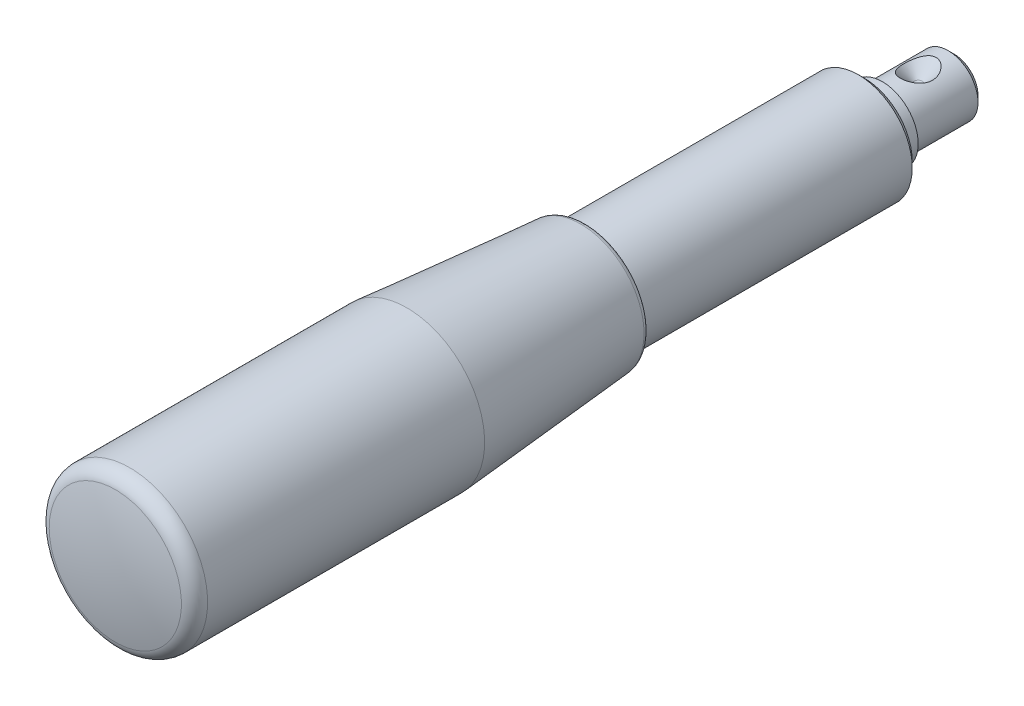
ISO-10303-21;
HEADER;
FILE_DESCRIPTION(('STEP AP214'),'2;1');
FILE_NAME('part.step','',(''),(''),'','','');
FILE_SCHEMA(('AUTOMOTIVE_DESIGN { 1 0 10303 214 1 1 1 1 }'));
ENDSEC;
DATA;
#1=APPLICATION_CONTEXT('core data for automotive mechanical design processes');
#2=APPLICATION_PROTOCOL_DEFINITION('international standard','automotive_design',2000,#1);
#3=PRODUCT_CONTEXT('',#1,'mechanical');
#4=PRODUCT('Part','Part','',(#3));
#5=PRODUCT_RELATED_PRODUCT_CATEGORY('part','',(#4));
#6=PRODUCT_DEFINITION_FORMATION('','',#4);
#7=PRODUCT_DEFINITION_CONTEXT('part definition',#1,'design');
#8=PRODUCT_DEFINITION('design','',#6,#7);
#9=PRODUCT_DEFINITION_SHAPE('','',#8);
#10=(LENGTH_UNIT() NAMED_UNIT(*) SI_UNIT(.MILLI.,.METRE.));
#11=(NAMED_UNIT(*) PLANE_ANGLE_UNIT() SI_UNIT($,.RADIAN.));
#12=(NAMED_UNIT(*) SI_UNIT($,.STERADIAN.) SOLID_ANGLE_UNIT());
#13=UNCERTAINTY_MEASURE_WITH_UNIT(LENGTH_MEASURE(1.E-05),#10,'distance_accuracy_value','');
#14=(GEOMETRIC_REPRESENTATION_CONTEXT(3) GLOBAL_UNCERTAINTY_ASSIGNED_CONTEXT((#13)) GLOBAL_UNIT_ASSIGNED_CONTEXT((#10,
#11,#12)) REPRESENTATION_CONTEXT('',''));
#15=CARTESIAN_POINT('',(0.,0.,0.));
#16=DIRECTION('',(0.,0.,1.));
#17=DIRECTION('',(1.,0.,0.));
#18=AXIS2_PLACEMENT_3D('',#15,#16,#17);
#19=CARTESIAN_POINT('',(0.,0.,46.5));
#20=DIRECTION('',(0.,0.,-1.));
#21=DIRECTION('',(0.984807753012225,0.173648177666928,0.));
#22=AXIS2_PLACEMENT_3D('',#19,#20,#21);
#23=PLANE('',#22);
#24=CARTESIAN_POINT('',(0.,0.,46.5));
#25=DIRECTION('',(0.,0.,-1.));
#26=DIRECTION('',(-1.,0.,0.));
#27=AXIS2_PLACEMENT_3D('',#24,#25,#26);
#28=CIRCLE('',#27,8.5);
#29=CARTESIAN_POINT('',(-8.5,0.,46.5));
#30=VERTEX_POINT('',#29);
#31=EDGE_CURVE('E24',#30,#30,#28,.F.);
#32=ORIENTED_EDGE('',*,*,#31,.T.);
#33=EDGE_LOOP('',(#32));
#34=FACE_BOUND('',#33,.T.);
#35=CARTESIAN_POINT('',(0.,0.,46.5));
#36=DIRECTION('',(0.,0.,-1.));
#37=DIRECTION('',(0.984807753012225,0.173648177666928,0.));
#38=AXIS2_PLACEMENT_3D('',#35,#36,#37);
#39=CIRCLE('',#38,9.57986711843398);
#40=CARTESIAN_POINT('',(9.43432741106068,1.66352646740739,46.5));
#41=VERTEX_POINT('',#40);
#42=EDGE_CURVE('E15',#41,#41,#39,.T.);
#43=ORIENTED_EDGE('',*,*,#42,.T.);
#44=EDGE_LOOP('',(#43));
#45=FACE_BOUND('',#44,.T.);
#46=ADVANCED_FACE('F12',(#34,#45),#23,.T.);
#47=CARTESIAN_POINT('',(0.,0.,47.5));
#48=DIRECTION('',(0.,0.,-1.));
#49=DIRECTION('',(0.984807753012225,0.173648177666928,0.));
#50=AXIS2_PLACEMENT_3D('',#47,#48,#49);
#51=TOROIDAL_SURFACE('',#50,9.57986711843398,1.);
#52=CARTESIAN_POINT('',(0.,0.,47.4169545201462));
#53=DIRECTION('',(0.,0.,-1.));
#54=DIRECTION('',(0.984807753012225,0.173648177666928,0.));
#55=AXIS2_PLACEMENT_3D('',#52,#53,#54);
#56=CIRCLE('',#55,10.5764128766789);
#57=CARTESIAN_POINT('',(10.4157334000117,1.83657482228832,47.4169545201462));
#58=VERTEX_POINT('',#57);
#59=EDGE_CURVE('E36',#58,#58,#56,.T.);
#60=ORIENTED_EDGE('',*,*,#59,.T.);
#61=EDGE_LOOP('',(#60));
#62=FACE_BOUND('',#61,.T.);
#63=ORIENTED_EDGE('',*,*,#42,.F.);
#64=EDGE_LOOP('',(#63));
#65=FACE_BOUND('',#64,.T.);
#66=ADVANCED_FACE('F117',(#62,#65),#51,.T.);
#67=CARTESIAN_POINT('',(0.,0.,47.4169545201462));
#68=DIRECTION('',(0.,0.,1.));
#69=DIRECTION('',(-0.984807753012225,-0.173648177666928,0.));
#70=AXIS2_PLACEMENT_3D('',#67,#68,#69);
#71=CONICAL_SURFACE('',#70,10.5764128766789,0.0831412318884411);
#72=CARTESIAN_POINT('',(-1.38100654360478E-13,3.46944695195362E-13,76.5));
#73=DIRECTION('',(0.,0.,-1.));
#74=DIRECTION('',(0.984807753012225,0.173648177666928,0.));
#75=AXIS2_PLACEMENT_3D('',#72,#73,#74);
#76=CIRCLE('',#75,13.);
#77=CARTESIAN_POINT('',(12.8025007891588,2.25742630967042,76.5));
#78=VERTEX_POINT('',#77);
#79=EDGE_CURVE('E34',#78,#78,#76,.T.);
#80=ORIENTED_EDGE('',*,*,#79,.T.);
#81=EDGE_LOOP('',(#80));
#82=FACE_BOUND('',#81,.T.);
#83=ORIENTED_EDGE('',*,*,#59,.F.);
#84=EDGE_LOOP('',(#83));
#85=FACE_BOUND('',#84,.T.);
#86=ADVANCED_FACE('F123',(#82,#85),#71,.T.);
#87=CARTESIAN_POINT('',(0.,0.,46.5));
#88=DIRECTION('',(0.,0.,-1.));
#89=DIRECTION('',(0.984807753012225,0.173648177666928,0.));
#90=AXIS2_PLACEMENT_3D('',#87,#88,#89);
#91=CYLINDRICAL_SURFACE('',#90,13.);
#92=CARTESIAN_POINT('',(0.,4.5102810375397E-13,122.824939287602));
#93=DIRECTION('',(0.,0.,-1.));
#94=DIRECTION('',(0.984807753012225,0.173648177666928,0.));
#95=AXIS2_PLACEMENT_3D('',#92,#93,#94);
#96=CIRCLE('',#95,13.);
#97=CARTESIAN_POINT('',(12.8025007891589,2.25742630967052,122.824939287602));
#98=VERTEX_POINT('',#97);
#99=EDGE_CURVE('E31',#98,#98,#96,.T.);
#100=ORIENTED_EDGE('',*,*,#99,.T.);
#101=EDGE_LOOP('',(#100));
#102=FACE_BOUND('',#101,.T.);
#103=ORIENTED_EDGE('',*,*,#79,.F.);
#104=EDGE_LOOP('',(#103));
#105=FACE_BOUND('',#104,.T.);
#106=ADVANCED_FACE('F143',(#102,#105),#91,.T.);
#107=CARTESIAN_POINT('',(0.,4.5102810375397E-13,122.824939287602));
#108=DIRECTION('',(0.,0.,-1.));
#109=DIRECTION('',(0.984807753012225,0.173648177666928,0.));
#110=AXIS2_PLACEMENT_3D('',#107,#108,#109);
#111=TOROIDAL_SURFACE('',#110,10.5,2.5);
#112=CARTESIAN_POINT('',(0.,3.46944695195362E-13,125.263093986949));
#113=DIRECTION('',(0.,0.,-1.));
#114=DIRECTION('',(0.984807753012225,0.173648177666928,0.));
#115=AXIS2_PLACEMENT_3D('',#112,#113,#114);
#116=CIRCLE('',#115,11.0526315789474);
#117=CARTESIAN_POINT('',(10.8847172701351,1.91926933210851,125.263093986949));
#118=VERTEX_POINT('',#117);
#119=EDGE_CURVE('E28',#118,#118,#116,.T.);
#120=ORIENTED_EDGE('',*,*,#119,.T.);
#121=EDGE_LOOP('',(#120));
#122=FACE_BOUND('',#121,.T.);
#123=ORIENTED_EDGE('',*,*,#99,.F.);
#124=EDGE_LOOP('',(#123));
#125=FACE_BOUND('',#124,.T.);
#126=ADVANCED_FACE('F136',(#122,#125),#111,.T.);
#127=CARTESIAN_POINT('',(-1.38100654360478E-13,3.46944695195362E-13,76.5));
#128=DIRECTION('',(0.,0.,-1.));
#129=DIRECTION('',(0.17364817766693,-0.984807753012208,0.));
#130=AXIS2_PLACEMENT_3D('',#127,#128,#129);
#131=SPHERICAL_SURFACE('',#130,50.);
#132=ORIENTED_EDGE('',*,*,#119,.F.);
#133=EDGE_LOOP('',(#132));
#134=FACE_BOUND('',#133,.T.);
#135=ADVANCED_FACE('F90',(#134),#131,.T.);
#136=CARTESIAN_POINT('',(0.,0.,46.));
#137=DIRECTION('',(0.,0.,-1.));
#138=DIRECTION('',(-1.,0.,0.));
#139=AXIS2_PLACEMENT_3D('',#136,#137,#138);
#140=CONICAL_SURFACE('',#139,9.,0.785398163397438);
#141=ORIENTED_EDGE('',*,*,#31,.F.);
#142=EDGE_LOOP('',(#141));
#143=FACE_BOUND('',#142,.T.);
#144=CARTESIAN_POINT('',(0.,0.,46.));
#145=DIRECTION('',(0.,0.,-1.));
#146=DIRECTION('',(-1.,0.,0.));
#147=AXIS2_PLACEMENT_3D('',#144,#145,#146);
#148=CIRCLE('',#147,9.);
#149=CARTESIAN_POINT('',(-9.00000000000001,0.,46.));
#150=VERTEX_POINT('',#149);
#151=EDGE_CURVE('E72',#150,#150,#148,.T.);
#152=ORIENTED_EDGE('',*,*,#151,.F.);
#153=EDGE_LOOP('',(#152));
#154=FACE_BOUND('',#153,.T.);
#155=ADVANCED_FACE('F85',(#143,#154),#140,.T.);
#156=CARTESIAN_POINT('',(0.,0.,-15.));
#157=DIRECTION('',(0.,0.,-1.));
#158=DIRECTION('',(-1.,0.,0.));
#159=AXIS2_PLACEMENT_3D('',#156,#157,#158);
#160=CYLINDRICAL_SURFACE('',#159,9.);
#161=CARTESIAN_POINT('',(0.,0.,1.));
#162=DIRECTION('',(0.,0.,1.));
#163=DIRECTION('',(1.,0.,0.));
#164=AXIS2_PLACEMENT_3D('',#161,#162,#163);
#165=CIRCLE('',#164,9.);
#166=CARTESIAN_POINT('',(8.99999999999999,0.,1.));
#167=VERTEX_POINT('',#166);
#168=EDGE_CURVE('E8',#167,#167,#165,.T.);
#169=ORIENTED_EDGE('',*,*,#168,.T.);
#170=EDGE_LOOP('',(#169));
#171=FACE_BOUND('',#170,.T.);
#172=ORIENTED_EDGE('',*,*,#151,.T.);
#173=EDGE_LOOP('',(#172));
#174=FACE_BOUND('',#173,.T.);
#175=ADVANCED_FACE('F94',(#171,#174),#160,.T.);
#176=CARTESIAN_POINT('',(0.,0.,0.));
#177=DIRECTION('',(0.,0.,1.));
#178=DIRECTION('',(1.,0.,0.));
#179=AXIS2_PLACEMENT_3D('',#176,#177,#178);
#180=CONICAL_SURFACE('',#179,8.,0.785398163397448);
#181=ORIENTED_EDGE('',*,*,#168,.F.);
#182=EDGE_LOOP('',(#181));
#183=FACE_BOUND('',#182,.T.);
#184=CARTESIAN_POINT('',(0.,0.,0.));
#185=DIRECTION('',(0.,0.,1.));
#186=DIRECTION('',(1.,0.,0.));
#187=AXIS2_PLACEMENT_3D('',#184,#185,#186);
#188=CIRCLE('',#187,8.);
#189=CARTESIAN_POINT('',(8.,0.,0.));
#190=VERTEX_POINT('',#189);
#191=EDGE_CURVE('E19',#190,#190,#188,.F.);
#192=ORIENTED_EDGE('',*,*,#191,.F.);
#193=EDGE_LOOP('',(#192));
#194=FACE_BOUND('',#193,.T.);
#195=ADVANCED_FACE('F97',(#183,#194),#180,.T.);
#196=CARTESIAN_POINT('',(0.,6.,0.));
#197=DIRECTION('',(0.,0.,1.));
#198=DIRECTION('',(1.,0.,0.));
#199=AXIS2_PLACEMENT_3D('',#196,#197,#198);
#200=PLANE('',#199);
#201=ORIENTED_EDGE('',*,*,#191,.T.);
#202=EDGE_LOOP('',(#201));
#203=FACE_BOUND('',#202,.T.);
#204=CARTESIAN_POINT('',(0.,0.,0.));
#205=DIRECTION('',(0.,0.,-1.));
#206=DIRECTION('',(-1.,0.,0.));
#207=AXIS2_PLACEMENT_3D('',#204,#205,#206);
#208=CIRCLE('',#207,6.);
#209=CARTESIAN_POINT('',(-6.,0.,0.));
#210=VERTEX_POINT('',#209);
#211=EDGE_CURVE('E45',#210,#210,#208,.T.);
#212=ORIENTED_EDGE('',*,*,#211,.F.);
#213=EDGE_LOOP('',(#212));
#214=FACE_BOUND('',#213,.T.);
#215=ADVANCED_FACE('F98',(#203,#214),#200,.F.);
#216=CARTESIAN_POINT('',(0.,0.,-15.));
#217=DIRECTION('',(0.,0.,-1.));
#218=DIRECTION('',(-1.,0.,0.));
#219=AXIS2_PLACEMENT_3D('',#216,#217,#218);
#220=CYLINDRICAL_SURFACE('',#219,6.);
#221=CARTESIAN_POINT('',(0.,0.,-3.));
#222=DIRECTION('',(0.,0.,-1.));
#223=DIRECTION('',(-1.,0.,0.));
#224=AXIS2_PLACEMENT_3D('',#221,#222,#223);
#225=CIRCLE('',#224,6.);
#226=CARTESIAN_POINT('',(-6.,0.,-3.));
#227=VERTEX_POINT('',#226);
#228=EDGE_CURVE('E50',#227,#227,#225,.T.);
#229=ORIENTED_EDGE('',*,*,#228,.F.);
#230=EDGE_LOOP('',(#229));
#231=FACE_BOUND('',#230,.T.);
#232=ORIENTED_EDGE('',*,*,#211,.T.);
#233=EDGE_LOOP('',(#232));
#234=FACE_BOUND('',#233,.T.);
#235=ADVANCED_FACE('F101',(#231,#234),#220,.T.);
#236=CARTESIAN_POINT('',(0.,5.,-3.));
#237=DIRECTION('',(0.,0.,1.));
#238=DIRECTION('',(1.,0.,0.));
#239=AXIS2_PLACEMENT_3D('',#236,#237,#238);
#240=PLANE('',#239);
#241=CARTESIAN_POINT('',(0.,0.,-3.));
#242=DIRECTION('',(0.,0.,-1.));
#243=DIRECTION('',(-1.,0.,0.));
#244=AXIS2_PLACEMENT_3D('',#241,#242,#243);
#245=CIRCLE('',#244,5.);
#246=CARTESIAN_POINT('',(-5.,0.,-3.));
#247=VERTEX_POINT('',#246);
#248=EDGE_CURVE('E55',#247,#247,#245,.T.);
#249=ORIENTED_EDGE('',*,*,#248,.F.);
#250=EDGE_LOOP('',(#249));
#251=FACE_BOUND('',#250,.T.);
#252=ORIENTED_EDGE('',*,*,#228,.T.);
#253=EDGE_LOOP('',(#252));
#254=FACE_BOUND('',#253,.T.);
#255=ADVANCED_FACE('F104',(#251,#254),#240,.F.);
#256=CARTESIAN_POINT('',(0.,0.,-15.));
#257=DIRECTION('',(0.,0.,-1.));
#258=DIRECTION('',(-1.,0.,0.));
#259=AXIS2_PLACEMENT_3D('',#256,#257,#258);
#260=CYLINDRICAL_SURFACE('',#259,5.);
#261=ORIENTED_EDGE('',*,*,#248,.T.);
#262=EDGE_LOOP('',(#261));
#263=FACE_BOUND('',#262,.T.);
#264=CARTESIAN_POINT('',(0.,0.,-14.));
#265=DIRECTION('',(0.,0.,1.));
#266=DIRECTION('',(1.,0.,0.));
#267=AXIS2_PLACEMENT_3D('',#264,#265,#266);
#268=CIRCLE('',#267,5.);
#269=CARTESIAN_POINT('',(5.00000000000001,0.,-14.));
#270=VERTEX_POINT('',#269);
#271=EDGE_CURVE('E61',#270,#270,#268,.T.);
#272=ORIENTED_EDGE('',*,*,#271,.T.);
#273=EDGE_LOOP('',(#272));
#274=FACE_BOUND('',#273,.T.);
#275=CARTESIAN_POINT('',(2.02245985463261,4.5727079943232,-10.5901197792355));
#276=CARTESIAN_POINT('',(1.94543304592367,4.60678027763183,-10.7432202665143));
#277=CARTESIAN_POINT('',(1.85643501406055,4.64384819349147,-10.8897917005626));
#278=CARTESIAN_POINT('',(1.6543054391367,4.71962880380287,-11.1650309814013));
#279=CARTESIAN_POINT('',(1.54117462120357,4.7583414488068,-11.2936993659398));
#280=CARTESIAN_POINT('',(1.32669043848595,4.82167666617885,-11.4931809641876));
#281=CARTESIAN_POINT('',(1.23120187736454,4.84716557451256,-11.5700222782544));
#282=CARTESIAN_POINT('',(1.02856938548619,4.89416051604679,-11.7078806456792));
#283=CARTESIAN_POINT('',(0.921446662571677,4.91567360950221,-11.7689258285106));
#284=CARTESIAN_POINT('',(0.714996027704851,4.94953702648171,-11.8634026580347));
#285=CARTESIAN_POINT('',(0.617126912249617,4.96279946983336,-11.8996784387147));
#286=CARTESIAN_POINT('',(0.416276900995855,4.98366103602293,-11.9562987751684));
#287=CARTESIAN_POINT('',(0.313298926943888,4.99126335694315,-11.9766523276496));
#288=CARTESIAN_POINT('',(0.104720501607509,4.99999581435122,-12.0000061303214));
#289=CARTESIAN_POINT('',(-0.000887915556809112,5.00110303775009,-12.0029449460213));
#290=CARTESIAN_POINT('',(-0.21095206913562,4.99665290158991,-11.9910687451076));
#291=CARTESIAN_POINT('',(-0.315407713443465,4.9910950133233,-11.9762523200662));
#292=CARTESIAN_POINT('',(-0.514401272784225,4.97441780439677,-11.9312675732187));
#293=CARTESIAN_POINT('',(-0.609169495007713,4.96361787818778,-11.9019793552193));
#294=CARTESIAN_POINT('',(-0.792908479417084,4.93760312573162,-11.8302616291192));
#295=CARTESIAN_POINT('',(-0.881876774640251,4.92238643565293,-11.78782657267));
#296=CARTESIAN_POINT('',(-1.08517296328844,4.88229605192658,-11.6735270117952));
#297=CARTESIAN_POINT('',(-1.19636802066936,4.85594652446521,-11.5966018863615));
#298=CARTESIAN_POINT('',(-1.40418891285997,4.7999896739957,-11.426018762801));
#299=CARTESIAN_POINT('',(-1.50078362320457,4.77037561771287,-11.3323259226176));
#300=CARTESIAN_POINT('',(-1.70320630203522,4.70248559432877,-11.1047790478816));
#301=CARTESIAN_POINT('',(-1.80446709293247,4.66403292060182,-10.966916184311));
#302=CARTESIAN_POINT('',(-1.98311390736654,4.59092413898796,-10.6757207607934));
#303=CARTESIAN_POINT('',(-2.06048643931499,4.55627018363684,-10.5223795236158));
#304=CARTESIAN_POINT('',(-2.19209060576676,4.49445297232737,-10.2025781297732));
#305=CARTESIAN_POINT('',(-2.2460666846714,4.46737353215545,-10.0359955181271));
#306=CARTESIAN_POINT('',(-2.30840326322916,4.43528937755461,-9.78070497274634));
#307=CARTESIAN_POINT('',(-2.32607941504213,4.42601603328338,-9.69468536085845));
#308=CARTESIAN_POINT('',(-2.35517987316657,4.41060161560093,-9.52132523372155));
#309=CARTESIAN_POINT('',(-2.36660620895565,4.40445952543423,-9.43398515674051));
#310=CARTESIAN_POINT('',(-2.38360823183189,4.39528268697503,-9.25377285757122));
#311=CARTESIAN_POINT('',(-2.3888322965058,4.39243490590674,-9.16085789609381));
#312=CARTESIAN_POINT('',(-2.39225075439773,4.39057396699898,-8.97485775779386));
#313=CARTESIAN_POINT('',(-2.39044487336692,4.39156095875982,-8.88177257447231));
#314=CARTESIAN_POINT('',(-2.37981065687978,4.39733329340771,-8.69612514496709));
#315=CARTESIAN_POINT('',(-2.37098289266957,4.40211832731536,-8.60356285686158));
#316=CARTESIAN_POINT('',(-2.34635466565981,4.41529208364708,-8.41962117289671));
#317=CARTESIAN_POINT('',(-2.33055166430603,4.42368211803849,-8.3282422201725));
#318=CARTESIAN_POINT('',(-2.27340812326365,4.45348338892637,-8.05989108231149));
#319=CARTESIAN_POINT('',(-2.22214098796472,4.47964645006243,-7.88543369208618));
#320=CARTESIAN_POINT('',(-2.09328021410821,4.54128142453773,-7.54807904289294));
#321=CARTESIAN_POINT('',(-2.01564910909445,4.5767665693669,-7.38519863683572));
#322=CARTESIAN_POINT('',(-1.83223514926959,4.65328177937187,-7.07259763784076));
#323=CARTESIAN_POINT('',(-1.72589385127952,4.69441288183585,-6.92322643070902));
#324=CARTESIAN_POINT('',(-1.48563475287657,4.77586085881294,-6.64845789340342));
#325=CARTESIAN_POINT('',(-1.35180714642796,4.81617993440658,-6.52298467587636));
#326=CARTESIAN_POINT('',(-1.11381943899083,4.87526164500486,-6.3469213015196));
#327=CARTESIAN_POINT('',(-1.01783339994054,4.89637807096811,-6.28602913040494));
#328=CARTESIAN_POINT('',(-0.816705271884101,4.9339051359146,-6.17983406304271));
#329=CARTESIAN_POINT('',(-0.711572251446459,4.95032036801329,-6.13451594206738));
#330=CARTESIAN_POINT('',(-0.493337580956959,4.9768238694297,-6.062102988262));
#331=CARTESIAN_POINT('',(-0.380176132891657,4.98685753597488,-6.03516528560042));
#332=CARTESIAN_POINT('',(-0.150413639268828,4.99905627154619,-6.00248294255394));
#333=CARTESIAN_POINT('',(-0.0338151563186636,5.00122706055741,-5.99672289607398));
#334=CARTESIAN_POINT('',(0.18357307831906,4.9976616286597,-6.00624070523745));
#335=CARTESIAN_POINT('',(0.284502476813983,4.99288784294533,-6.01895759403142));
#336=CARTESIAN_POINT('',(0.482657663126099,4.97764199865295,-6.0600043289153));
#337=CARTESIAN_POINT('',(0.57988299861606,4.96716924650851,-6.08833607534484));
#338=CARTESIAN_POINT('',(0.769408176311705,4.94138335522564,-6.15923761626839));
#339=CARTESIAN_POINT('',(0.861646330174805,4.92602104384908,-6.20195231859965));
#340=CARTESIAN_POINT('',(1.03876788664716,4.89173968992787,-6.29943278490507));
#341=CARTESIAN_POINT('',(1.12364654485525,4.87281837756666,-6.35420624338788));
#342=CARTESIAN_POINT('',(1.32417585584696,4.82304491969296,-6.50252112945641));
#343=CARTESIAN_POINT('',(1.43506575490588,4.79082240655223,-6.60205810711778));
#344=CARTESIAN_POINT('',(1.63868983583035,4.7250604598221,-6.81787741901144));
#345=CARTESIAN_POINT('',(1.73139084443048,4.69151875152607,-6.93418969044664));
#346=CARTESIAN_POINT('',(1.90012446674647,4.62578229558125,-7.1817669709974));
#347=CARTESIAN_POINT('',(1.97583646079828,4.5936214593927,-7.31325832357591));
#348=CARTESIAN_POINT('',(2.10854388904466,4.53423903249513,-7.58629164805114));
#349=CARTESIAN_POINT('',(2.16554471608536,4.50701601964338,-7.72783070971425));
#350=CARTESIAN_POINT('',(2.26960086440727,4.4556619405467,-8.04541657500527));
#351=CARTESIAN_POINT('',(2.31282968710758,4.43304975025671,-8.22298243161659));
#352=CARTESIAN_POINT('',(2.37222944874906,4.40155385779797,-8.58386505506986));
#353=CARTESIAN_POINT('',(2.38838730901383,4.39267679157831,-8.76718455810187));
#354=CARTESIAN_POINT('',(2.39330315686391,4.39000140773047,-9.13561047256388));
#355=CARTESIAN_POINT('',(2.38186390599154,4.39631163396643,-9.32072027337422));
#356=CARTESIAN_POINT('',(2.33142467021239,4.42326379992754,-9.68586713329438));
#357=CARTESIAN_POINT('',(2.2924623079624,4.44388617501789,-9.86591076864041));
#358=CARTESIAN_POINT('',(2.21168856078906,4.48435070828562,-10.1358187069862));
#359=CARTESIAN_POINT('',(2.17934498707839,4.50022904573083,-10.2292377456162));
#360=CARTESIAN_POINT('',(2.10680032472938,4.53464551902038,-10.4125268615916));
#361=CARTESIAN_POINT('',(2.06659525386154,4.55318500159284,-10.5023951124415));
#362=CARTESIAN_POINT('',(2.02245985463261,4.5727079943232,-10.5901197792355));
#363=B_SPLINE_CURVE_WITH_KNOTS('',3,(#275,#276,#277,#278,#279,#280,#281,#282,#283,#284,#285,
#286,#287,#288,#289,#290,#291,#292,#293,#294,#295,#296,#297,#298,#299,#300,#301,#302,#303,#304,
#305,#306,#307,#308,#309,#310,#311,#312,#313,#314,#315,#316,#317,#318,#319,#320,#321,#322,#323,
#324,#325,#326,#327,#328,#329,#330,#331,#332,#333,#334,#335,#336,#337,#338,#339,#340,#341,#342,
#343,#344,#345,#346,#347,#348,#349,#350,#351,#352,#353,#354,#355,#356,#357,#358,#359,#360,#361,
#362),.UNSPECIFIED.,.T.,.F.,(4,2,2,2,2,2,2,2,2,2,2,2,2,2,2,2,2,2,2,2,2,2,2,2,2,2,2,2,2,2,2,2,2,
2,2,2,2,2,2,2,2,2,2,4),(0.,0.52388087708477,1.04774601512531,1.42198870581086,1.79556029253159,
2.10987639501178,2.42401476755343,2.73926067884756,3.05453159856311,3.35263108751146,
3.65085655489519,4.06185833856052,4.47372428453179,4.9969704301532,5.52051155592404,
6.04963534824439,6.31431654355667,6.57891173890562,6.85788347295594,7.13686609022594,
7.41582601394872,7.69488754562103,8.24329847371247,8.79249204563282,9.35325160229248,
9.9121996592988,10.257796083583,10.6030536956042,10.9512270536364,11.2991470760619,
11.6032000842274,11.9072901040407,12.2145403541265,12.521987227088,12.9768585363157,
13.4325518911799,13.8962320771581,14.3597785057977,14.9096135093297,15.4597140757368,
16.0137578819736,16.567045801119,16.8670706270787,17.1672478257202),.UNSPECIFIED.);
#364=CARTESIAN_POINT('',(2.02245985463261,4.5727079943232,-10.5901197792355));
#365=VERTEX_POINT('',#364);
#366=EDGE_CURVE('E64',#365,#365,#363,.T.);
#367=ORIENTED_EDGE('',*,*,#366,.F.);
#368=EDGE_LOOP('',(#367));
#369=FACE_BOUND('',#368,.T.);
#370=ADVANCED_FACE('F73',(#263,#274,#369),#260,.T.);
#371=CARTESIAN_POINT('',(0.,0.,-15.));
#372=DIRECTION('',(0.,0.,1.));
#373=DIRECTION('',(1.,0.,0.));
#374=AXIS2_PLACEMENT_3D('',#371,#372,#373);
#375=CONICAL_SURFACE('',#374,4.,0.785398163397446);
#376=ORIENTED_EDGE('',*,*,#271,.F.);
#377=EDGE_LOOP('',(#376));
#378=FACE_BOUND('',#377,.T.);
#379=CARTESIAN_POINT('',(0.,0.,-15.));
#380=DIRECTION('',(0.,0.,1.));
#381=DIRECTION('',(1.,0.,0.));
#382=AXIS2_PLACEMENT_3D('',#379,#380,#381);
#383=CIRCLE('',#382,4.);
#384=CARTESIAN_POINT('',(4.00000000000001,0.,-15.));
#385=VERTEX_POINT('',#384);
#386=EDGE_CURVE('E58',#385,#385,#383,.F.);
#387=ORIENTED_EDGE('',*,*,#386,.F.);
#388=EDGE_LOOP('',(#387));
#389=FACE_BOUND('',#388,.T.);
#390=ADVANCED_FACE('F83',(#378,#389),#375,.T.);
#391=CARTESIAN_POINT('',(0.,2.70710678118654,-9.));
#392=DIRECTION('',(0.,1.,0.));
#393=DIRECTION('',(0.,0.,-1.));
#394=AXIS2_PLACEMENT_3D('',#391,#392,#393);
#395=CONICAL_SURFACE('',#394,0.70710678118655,0.785398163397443);
#396=CARTESIAN_POINT('',(0.,2.70710678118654,-9.));
#397=DIRECTION('',(0.,1.,0.));
#398=DIRECTION('',(0.,0.,-1.));
#399=AXIS2_PLACEMENT_3D('',#396,#397,#398);
#400=CIRCLE('',#399,0.70710678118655);
#401=CARTESIAN_POINT('',(0.,2.70710678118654,-9.70710678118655));
#402=VERTEX_POINT('',#401);
#403=EDGE_CURVE('E41',#402,#402,#400,.T.);
#404=ORIENTED_EDGE('',*,*,#403,.F.);
#405=EDGE_LOOP('',(#404));
#406=FACE_BOUND('',#405,.T.);
#407=ORIENTED_EDGE('',*,*,#366,.T.);
#408=EDGE_LOOP('',(#407));
#409=FACE_BOUND('',#408,.T.);
#410=ADVANCED_FACE('F77',(#406,#409),#395,.F.);
#411=CARTESIAN_POINT('',(0.,0.,-15.));
#412=DIRECTION('',(0.,0.,1.));
#413=DIRECTION('',(1.,0.,0.));
#414=AXIS2_PLACEMENT_3D('',#411,#412,#413);
#415=PLANE('',#414);
#416=ORIENTED_EDGE('',*,*,#386,.T.);
#417=EDGE_LOOP('',(#416));
#418=FACE_BOUND('',#417,.T.);
#419=ADVANCED_FACE('F82',(#418),#415,.F.);
#420=CARTESIAN_POINT('',(0.,3.41421356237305,-9.));
#421=DIRECTION('',(0.,1.,0.));
#422=DIRECTION('',(0.,0.,1.));
#423=AXIS2_PLACEMENT_3D('',#420,#421,#422);
#424=SPHERICAL_SURFACE('',#423,1.);
#425=ORIENTED_EDGE('',*,*,#403,.T.);
#426=EDGE_LOOP('',(#425));
#427=FACE_BOUND('',#426,.T.);
#428=ADVANCED_FACE('F87',(#427),#424,.F.);
#429=CLOSED_SHELL('',(#46,#66,#86,#106,#126,#135,#155,#175,#195,#215,#235,#255,#370,#390,#410,
#419,#428));
#430=MANIFOLD_SOLID_BREP('B1',#429);
#431=ADVANCED_BREP_SHAPE_REPRESENTATION('',(#18,#430),#14);
#432=SHAPE_DEFINITION_REPRESENTATION(#9,#431);
ENDSEC;
END-ISO-10303-21;
